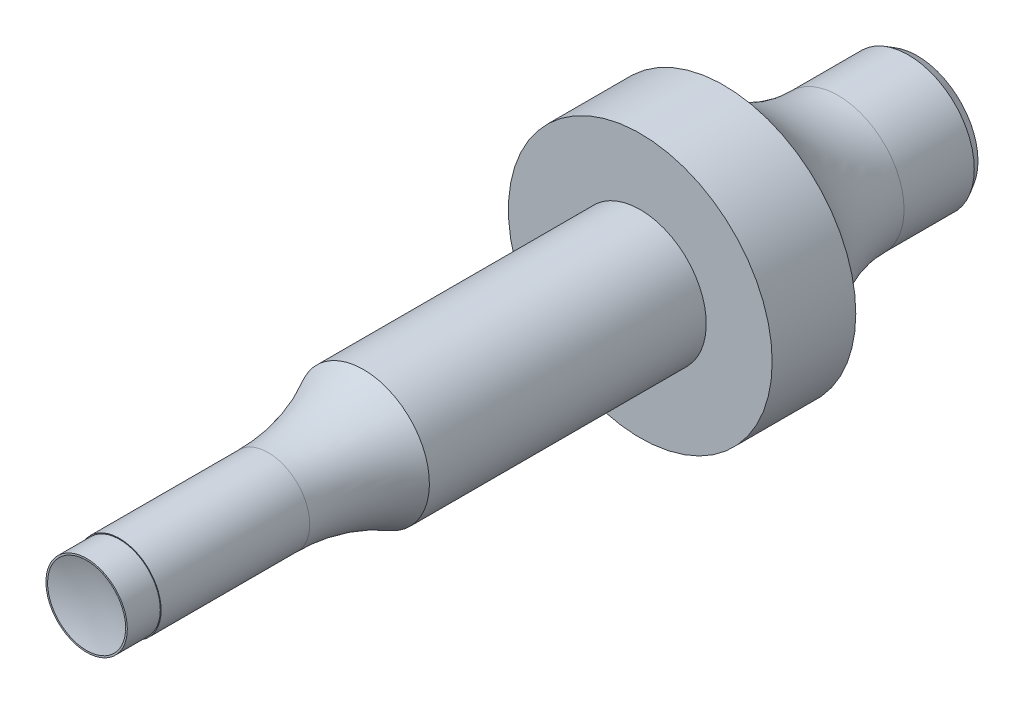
from build123d import *

# Parameters (mm, degrees)
SKETCH1_R           = 7.94
BOSS_EXTRUDE1_DEPTH = 100
SKETCH2_OUTSIDE_W   = 38.378
SKETCH2_OUTSIDE_H   = 38.378
SKETCH2_OUTSIDE_R   = 5
CUT_EXTRUDE1_DEPTH  = 33.333333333
SKETCH3_OUTSIDE_W   = 38.378
SKETCH3_OUTSIDE_H   = 38.378
SKETCH3_OUTSIDE_R   = 4.9
CUT_EXTRUDE2_DEPTH  = 3.97
CHAMFER1_SIZE       = 1.058666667
CHAMFER1_SIZE2      = 0.611221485


with BuildPart() as part:
    # Sketch1 → Boss-Extrude1 (new body)
    with BuildSketch(Plane.XY):
        Circle(SKETCH1_R)
    extrude(amount=-BOSS_EXTRUDE1_DEPTH)

    # Sketch2 outside → Cut-Extrude1 (cut)
    with BuildSketch(Plane.XY):
        Rectangle(SKETCH2_OUTSIDE_W, SKETCH2_OUTSIDE_H)
        Circle(SKETCH2_OUTSIDE_R, mode=Mode.SUBTRACT)
    extrude(amount=-CUT_EXTRUDE1_DEPTH, mode=Mode.SUBTRACT)

    # Sketch3 outside → Cut-Extrude2 (cut)
    with BuildSketch(Plane.XY):
        Rectangle(SKETCH3_OUTSIDE_W, SKETCH3_OUTSIDE_H)
        Circle(SKETCH3_OUTSIDE_R, mode=Mode.SUBTRACT)
    extrude(amount=-CUT_EXTRUDE2_DEPTH, mode=Mode.SUBTRACT)

    # Sketch4 → Cut-Revolve1 (revolve, cut)
    with BuildSketch(Plane(origin=(0, 0, 0), x_dir=(0, 0, -1), z_dir=(1, 0, 0)), mode=Mode.PRIVATE) as cut_revolve1_sk:
        with BuildLine():
            Line((0, 0), (0, 4.7))
            ThreePointArc((0, 4.7), (0.532592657, 2.376772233), (0.711466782, 0))
            Line((0.711466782, 0), (0, 0))
        make_face()
    revolve(cut_revolve1_sk.sketch.rotate(Axis((0, 0, 0), (0, 0, -1)), 180), axis=Axis((0, 0, 0), (0, 0, -1)), mode=Mode.SUBTRACT)

    # Chamfer1
    chamfer1_edges = [part.edges().sort_by_distance(p)[0] for p in [
        (-7.94, 0, -100),
    ]]
    chamfer1_side = [part.faces().sort_by_distance(p)[0] for p in [
        (-7.94, 0, -66.666666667),
    ]]
    chamfer(chamfer1_edges, length=CHAMFER1_SIZE, length2=CHAMFER1_SIZE2, reference=chamfer1_side[0])

    # Sketch5 → Revolve1 (revolve)
    with BuildSketch(Plane(origin=(0, 0, 0), x_dir=(0, 0, -1), z_dir=(1, 0, 0)), mode=Mode.PRIVATE) as revolve1_sk:
        with BuildLine():
            Line((33.333333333, 0), (21.86956432, 0))
            Line((21.86956432, 0), (21.86956432, 5))
            ThreePointArc((21.86956432, 5), (27.786945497, 5.746703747), (33.333333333, 7.94))
            Line((33.333333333, 7.94), (33.333333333, 0))
        make_face()
    revolve(revolve1_sk.sketch.rotate(Axis((0, 0, -33.333333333), (0, 0, 1)), 270), axis=Axis((0, 0, -33.333333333), (0, 0, 1)))

    # Sketch6 → Revolve2 (revolve)
    with BuildSketch(Plane(origin=(0, 0, 0), x_dir=(0, 0, -1), z_dir=(1, 0, 0)), mode=Mode.PRIVATE) as revolve2_sk:
        with BuildLine():
            Line((66.666666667, 0), (90.486666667, 0))
            Line((90.486666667, 0), (90.486666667, 7.94))
            ThreePointArc((90.486666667, 7.94), (82.546666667, 10.067516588), (76.734183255, 15.88))
            Line((76.734183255, 15.88), (66.666666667, 15.88))
            Line((66.666666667, 15.88), (66.666666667, 0))
        make_face()
    revolve(revolve2_sk.sketch.rotate(Axis((0, 0, -66.666666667), (0, 0, -1)), 90), axis=Axis((0, 0, -66.666666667), (0, 0, -1)))


solid = part.part
